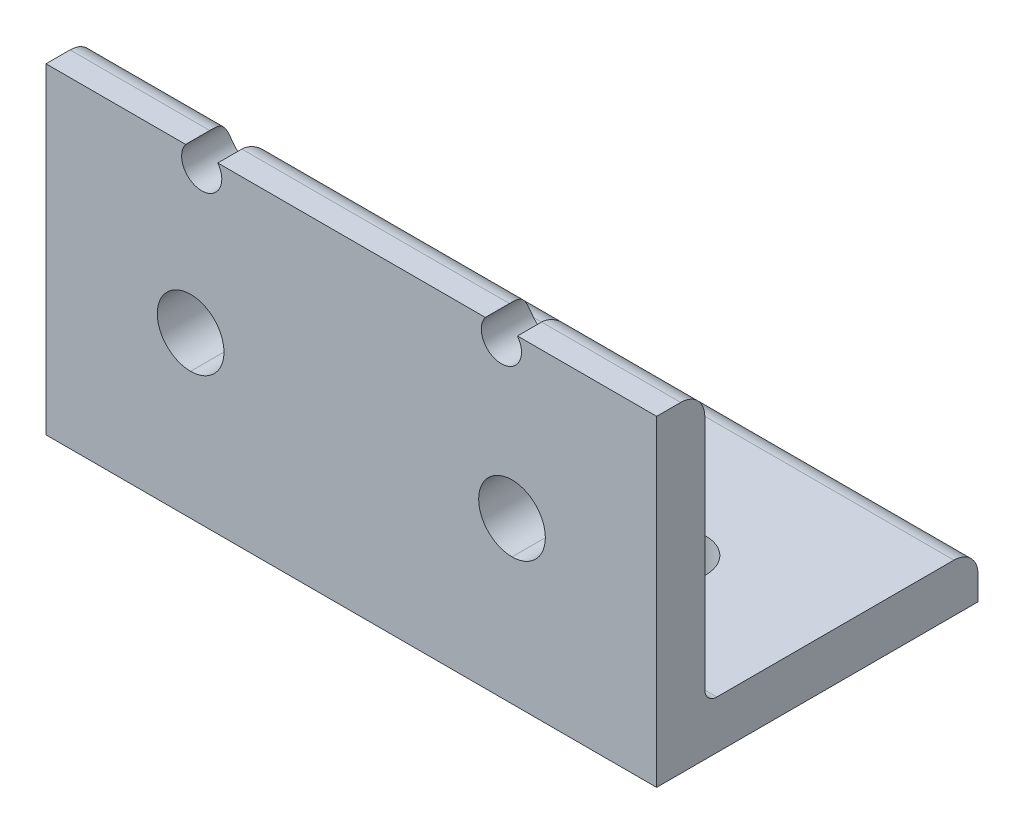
ISO-10303-21;
HEADER;
FILE_DESCRIPTION(('STEP AP214'),'2;1');
FILE_NAME('part.step','',(''),(''),'','','');
FILE_SCHEMA(('AUTOMOTIVE_DESIGN { 1 0 10303 214 1 1 1 1 }'));
ENDSEC;
DATA;
#1=APPLICATION_CONTEXT('core data for automotive mechanical design processes');
#2=APPLICATION_PROTOCOL_DEFINITION('international standard','automotive_design',2000,#1);
#3=PRODUCT_CONTEXT('',#1,'mechanical');
#4=PRODUCT('Part','Part','',(#3));
#5=PRODUCT_RELATED_PRODUCT_CATEGORY('part','',(#4));
#6=PRODUCT_DEFINITION_FORMATION('','',#4);
#7=PRODUCT_DEFINITION_CONTEXT('part definition',#1,'design');
#8=PRODUCT_DEFINITION('design','',#6,#7);
#9=PRODUCT_DEFINITION_SHAPE('','',#8);
#10=(LENGTH_UNIT() NAMED_UNIT(*) SI_UNIT(.MILLI.,.METRE.));
#11=(NAMED_UNIT(*) PLANE_ANGLE_UNIT() SI_UNIT($,.RADIAN.));
#12=(NAMED_UNIT(*) SI_UNIT($,.STERADIAN.) SOLID_ANGLE_UNIT());
#13=UNCERTAINTY_MEASURE_WITH_UNIT(LENGTH_MEASURE(1.E-05),#10,'distance_accuracy_value','');
#14=(GEOMETRIC_REPRESENTATION_CONTEXT(3) GLOBAL_UNCERTAINTY_ASSIGNED_CONTEXT((#13)) GLOBAL_UNIT_ASSIGNED_CONTEXT((#10,
#11,#12)) REPRESENTATION_CONTEXT('',''));
#15=CARTESIAN_POINT('',(0.,0.,0.));
#16=DIRECTION('',(0.,0.,1.));
#17=DIRECTION('',(1.,0.,0.));
#18=AXIS2_PLACEMENT_3D('',#15,#16,#17);
#19=CARTESIAN_POINT('',(77.5199999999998,37.0000000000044,-3.0000000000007));
#20=DIRECTION('',(-1.,0.,0.));
#21=DIRECTION('',(0.,1.,0.));
#22=AXIS2_PLACEMENT_3D('',#19,#20,#21);
#23=CYLINDRICAL_SURFACE('',#22,3.0000000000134);
#24=CARTESIAN_POINT('',(54.6795507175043,37.0000000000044,-6.0000000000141));
#25=CARTESIAN_POINT('',(54.6449193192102,37.0461604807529,-6.00000555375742));
#26=CARTESIAN_POINT('',(54.6118943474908,37.0935385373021,-5.99893451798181));
#27=CARTESIAN_POINT('',(54.5492326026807,37.1903962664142,-5.99434346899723));
#28=CARTESIAN_POINT('',(54.5195972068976,37.2398767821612,-5.99082246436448));
#29=CARTESIAN_POINT('',(54.4639462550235,37.3405174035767,-5.98104010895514));
#30=CARTESIAN_POINT('',(54.4379270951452,37.391675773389,-5.97478151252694));
#31=CARTESIAN_POINT('',(54.3896213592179,37.4952630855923,-5.95930135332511));
#32=CARTESIAN_POINT('',(54.3673341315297,37.5476918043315,-5.95008030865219));
#33=CARTESIAN_POINT('',(54.3060993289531,37.7065409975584,-5.917609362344));
#34=CARTESIAN_POINT('',(54.2728981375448,37.8143065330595,-5.88957064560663));
#35=CARTESIAN_POINT('',(54.2218359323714,38.029004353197,-5.82026341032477));
#36=CARTESIAN_POINT('',(54.2039609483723,38.1359373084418,-5.77900698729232));
#37=CARTESIAN_POINT('',(54.1823774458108,38.3428778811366,-5.68501012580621));
#38=CARTESIAN_POINT('',(54.1783328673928,38.4429909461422,-5.63257551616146));
#39=CARTESIAN_POINT('',(54.1814013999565,38.6365539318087,-5.51683254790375));
#40=CARTESIAN_POINT('',(54.1885256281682,38.7299971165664,-5.4535134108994));
#41=CARTESIAN_POINT('',(54.2158865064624,38.9424771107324,-5.29145707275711));
#42=CARTESIAN_POINT('',(54.2400813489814,39.0577214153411,-5.18841126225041));
#43=CARTESIAN_POINT('',(54.298535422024,39.2700312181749,-4.96737477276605));
#44=CARTESIAN_POINT('',(54.3328167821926,39.3670559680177,-4.8493515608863));
#45=CARTESIAN_POINT('',(54.4056155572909,39.543289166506,-4.59862153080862));
#46=CARTESIAN_POINT('',(54.4441972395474,39.6221516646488,-4.46569168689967));
#47=CARTESIAN_POINT('',(54.5181327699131,39.7586885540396,-4.18884386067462));
#48=CARTESIAN_POINT('',(54.5534952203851,39.8164207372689,-4.04495716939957));
#49=CARTESIAN_POINT('',(54.5982350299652,39.8852193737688,-3.82528617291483));
#50=CARTESIAN_POINT('',(54.6115697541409,39.9049500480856,-3.75294170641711));
#51=CARTESIAN_POINT('',(54.6351282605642,39.9390150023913,-3.60649659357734));
#52=CARTESIAN_POINT('',(54.6453530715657,39.9533510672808,-3.53239653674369));
#53=CARTESIAN_POINT('',(54.6620950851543,39.9765132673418,-3.38232155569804));
#54=CARTESIAN_POINT('',(54.668582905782,39.9852957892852,-3.30633654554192));
#55=CARTESIAN_POINT('',(54.6773397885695,39.9970515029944,-3.15357753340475));
#56=CARTESIAN_POINT('',(54.6796031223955,40.0000168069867,-3.07680260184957));
#57=CARTESIAN_POINT('',(54.6795507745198,40.0000000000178,-3.00000000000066));
#58=B_SPLINE_CURVE_WITH_KNOTS('',3,(#24,#25,#26,#27,#28,#29,#30,#31,#32,#33,#34,#35,#36,#37,#38,
#39,#40,#41,#42,#43,#44,#45,#46,#47,#48,#49,#50,#51,#52,#53,#54,#55,#56,#57),.UNSPECIFIED.,.F.,
.F.,(4,2,2,2,2,2,2,2,2,2,2,2,2,2,2,2,4),(0.,0.173090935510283,0.346251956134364,
0.519239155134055,0.692196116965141,1.0388479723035,1.38518350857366,1.72304135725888,
2.06123571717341,2.52812901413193,2.9960544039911,3.47226658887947,3.94716641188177,
4.17543250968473,4.40362301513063,4.6335839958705,4.86385657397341),.UNSPECIFIED.);
#59=CARTESIAN_POINT('',(54.6795507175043,37.0000000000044,-5.99999999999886));
#60=VERTEX_POINT('',#59);
#61=CARTESIAN_POINT('',(54.67955077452,40.0000000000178,-3.0000000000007));
#62=VERTEX_POINT('',#61);
#63=EDGE_CURVE('E523',#60,#62,#58,.T.);
#64=ORIENTED_EDGE('',*,*,#63,.F.);
#65=DIRECTION('',(1.,0.,0.));
#66=VECTOR('',#65,1.);
#67=CARTESIAN_POINT('',(0.,37.0000000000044,-6.0000000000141));
#68=LINE('',#67,#66);
#69=CARTESIAN_POINT('',(21.3795506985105,37.0000000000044,-6.0000000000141));
#70=VERTEX_POINT('',#69);
#71=EDGE_CURVE('E519',#70,#60,#68,.T.);
#72=ORIENTED_EDGE('',*,*,#71,.F.);
#73=CARTESIAN_POINT('',(21.3795506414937,40.0000000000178,-3.0000000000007));
#74=CARTESIAN_POINT('',(21.3795004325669,40.0000160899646,-3.0759560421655));
#75=CARTESIAN_POINT('',(21.3817131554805,39.9971160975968,-3.15188584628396));
#76=CARTESIAN_POINT('',(21.3902803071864,39.9856169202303,-3.30298305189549));
#77=CARTESIAN_POINT('',(21.3966294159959,39.977025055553,-3.37815130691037));
#78=CARTESIAN_POINT('',(21.4130169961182,39.9543712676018,-3.52657955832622));
#79=CARTESIAN_POINT('',(21.4230236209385,39.9403565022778,-3.59985034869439));
#80=CARTESIAN_POINT('',(21.4460961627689,39.9070542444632,-3.74468955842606));
#81=CARTESIAN_POINT('',(21.4591629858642,39.8877651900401,-3.81625746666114));
#82=CARTESIAN_POINT('',(21.5017419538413,39.822495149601,-4.02717638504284));
#83=CARTESIAN_POINT('',(21.5347376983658,39.7689827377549,-4.16356367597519));
#84=CARTESIAN_POINT('',(21.6041003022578,39.6430509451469,-4.42678227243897));
#85=CARTESIAN_POINT('',(21.6404785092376,39.5705663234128,-4.55357861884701));
#86=CARTESIAN_POINT('',(21.71650958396,39.3940312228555,-4.81589056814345));
#87=CARTESIAN_POINT('',(21.7557191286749,39.2867517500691,-4.94941845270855));
#88=CARTESIAN_POINT('',(21.8050737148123,39.1087929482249,-5.13549943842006));
#89=CARTESIAN_POINT('',(21.8199430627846,39.0466720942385,-5.19512918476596));
#90=CARTESIAN_POINT('',(21.8454043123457,38.9170445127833,-5.30919658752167));
#91=CARTESIAN_POINT('',(21.8559983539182,38.8495405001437,-5.3636368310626));
#92=CARTESIAN_POINT('',(21.8748869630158,38.6816326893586,-5.48734265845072));
#93=CARTESIAN_POINT('',(21.8805765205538,38.5788504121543,-5.55385411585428));
#94=CARTESIAN_POINT('',(21.8782217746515,38.3661002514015,-5.67369460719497));
#95=CARTESIAN_POINT('',(21.8701956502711,38.2561420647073,-5.72704098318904));
#96=CARTESIAN_POINT('',(21.8379614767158,38.0319259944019,-5.81955660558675));
#97=CARTESIAN_POINT('',(21.8136696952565,37.9176487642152,-5.85865086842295));
#98=CARTESIAN_POINT('',(21.7476243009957,37.6898908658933,-5.92199064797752));
#99=CARTESIAN_POINT('',(21.7058574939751,37.5764108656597,-5.94622491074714));
#100=CARTESIAN_POINT('',(21.6184173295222,37.3839401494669,-5.97648973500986));
#101=CARTESIAN_POINT('',(21.576582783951,37.3036531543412,-5.98561495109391));
#102=CARTESIAN_POINT('',(21.507376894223,37.1868347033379,-5.99443093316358));
#103=CARTESIAN_POINT('',(21.4832517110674,37.1485227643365,-5.99655783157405));
#104=CARTESIAN_POINT('',(21.4329319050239,37.0732282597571,-5.99934297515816));
#105=CARTESIAN_POINT('',(21.4067373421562,37.0362456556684,-6.00000126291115));
#106=CARTESIAN_POINT('',(21.3795506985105,37.0000000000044,-6.0000000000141));
#107=B_SPLINE_CURVE_WITH_KNOTS('',3,(#73,#74,#75,#76,#77,#78,#79,#80,#81,#82,#83,#84,#85,#86,
#87,#88,#89,#90,#91,#92,#93,#94,#95,#96,#97,#98,#99,#100,#101,#102,#103,#104,#105,#106),
.UNSPECIFIED.,.F.,.F.,(4,2,2,2,2,2,2,2,2,2,2,2,2,2,2,2,4),(0.,0.227738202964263,
0.455184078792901,0.68069497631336,0.9062727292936,1.3549442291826,1.80517935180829,
2.32935378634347,2.59115439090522,2.85282378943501,3.21892209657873,3.5845355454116,
3.95204571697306,4.31983387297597,4.59200180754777,4.72789580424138,4.86378586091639),.UNSPECIFIED.);
#108=CARTESIAN_POINT('',(21.3795506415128,39.9999999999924,-3.00000000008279));
#109=VERTEX_POINT('',#108);
#110=EDGE_CURVE('E552',#109,#70,#107,.T.);
#111=ORIENTED_EDGE('',*,*,#110,.F.);
#112=DIRECTION('',(-1.,0.,0.));
#113=VECTOR('',#112,1.);
#114=CARTESIAN_POINT('',(76.0000000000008,40.0000000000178,-3.0000000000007));
#115=LINE('',#114,#113);
#116=EDGE_CURVE('E228',#62,#109,#115,.T.);
#117=ORIENTED_EDGE('',*,*,#116,.F.);
#118=EDGE_LOOP('',(#64,#72,#111,#117));
#119=FACE_BOUND('',#118,.T.);
#120=ADVANCED_FACE('F50',(#119),#23,.T.);
#121=CARTESIAN_POINT('',(17.3795506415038,37.0000000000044,-6.0000000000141));
#122=CARTESIAN_POINT('',(17.3449192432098,37.0461604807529,-6.00000555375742));
#123=CARTESIAN_POINT('',(17.3118942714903,37.0935385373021,-5.99893451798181));
#124=CARTESIAN_POINT('',(17.2492325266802,37.1903962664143,-5.99434346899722));
#125=CARTESIAN_POINT('',(17.2195971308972,37.2398767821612,-5.99082246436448));
#126=CARTESIAN_POINT('',(17.1639461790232,37.3405174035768,-5.98104010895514));
#127=CARTESIAN_POINT('',(17.1379270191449,37.391675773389,-5.97478151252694));
#128=CARTESIAN_POINT('',(17.0896212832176,37.4952630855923,-5.9593013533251));
#129=CARTESIAN_POINT('',(17.0673340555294,37.5476918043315,-5.95008030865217));
#130=CARTESIAN_POINT('',(17.0060992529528,37.7065409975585,-5.91760936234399));
#131=CARTESIAN_POINT('',(16.9728980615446,37.8143065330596,-5.8895706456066));
#132=CARTESIAN_POINT('',(16.9218358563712,38.0290043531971,-5.82026341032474));
#133=CARTESIAN_POINT('',(16.9039608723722,38.1359373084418,-5.77900698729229));
#134=CARTESIAN_POINT('',(16.8823773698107,38.3428778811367,-5.68501012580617));
#135=CARTESIAN_POINT('',(16.8783327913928,38.4429909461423,-5.63257551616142));
#136=CARTESIAN_POINT('',(16.8814013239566,38.6365539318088,-5.5168325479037));
#137=CARTESIAN_POINT('',(16.8885255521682,38.7299971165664,-5.45351341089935));
#138=CARTESIAN_POINT('',(16.9158864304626,38.9424771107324,-5.29145707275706));
#139=CARTESIAN_POINT('',(16.9400812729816,39.0577214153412,-5.18841126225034));
#140=CARTESIAN_POINT('',(16.9985353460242,39.270031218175,-4.96737477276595));
#141=CARTESIAN_POINT('',(17.0328167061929,39.3670559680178,-4.84935156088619));
#142=CARTESIAN_POINT('',(17.1056154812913,39.5432891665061,-4.59862153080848));
#143=CARTESIAN_POINT('',(17.1441971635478,39.6221516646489,-4.46569168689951));
#144=CARTESIAN_POINT('',(17.2181326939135,39.7586885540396,-4.18884386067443));
#145=CARTESIAN_POINT('',(17.2534951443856,39.816420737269,-4.04495716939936));
#146=CARTESIAN_POINT('',(17.2982349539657,39.8852193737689,-3.82528617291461));
#147=CARTESIAN_POINT('',(17.3115696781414,39.9049500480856,-3.75294170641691));
#148=CARTESIAN_POINT('',(17.3351281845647,39.9390150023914,-3.60649659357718));
#149=CARTESIAN_POINT('',(17.3453529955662,39.9533510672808,-3.53239653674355));
#150=CARTESIAN_POINT('',(17.3620950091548,39.9765132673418,-3.38232155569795));
#151=CARTESIAN_POINT('',(17.3685828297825,39.9852957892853,-3.30633654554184));
#152=CARTESIAN_POINT('',(17.37733971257,39.9970515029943,-3.15357753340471));
#153=CARTESIAN_POINT('',(17.379603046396,40.0000168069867,-3.07680260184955));
#154=CARTESIAN_POINT('',(17.3795506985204,40.0000000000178,-3.00000000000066));
#155=B_SPLINE_CURVE_WITH_KNOTS('',3,(#121,#122,#123,#124,#125,#126,#127,#128,#129,#130,#131,
#132,#133,#134,#135,#136,#137,#138,#139,#140,#141,#142,#143,#144,#145,#146,#147,#148,#149,#150,
#151,#152,#153,#154),.UNSPECIFIED.,.F.,.F.,(4,2,2,2,2,2,2,2,2,2,2,2,2,2,2,2,4),(0.,
0.17309093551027,0.34625195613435,0.519239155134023,0.692196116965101,1.03884797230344,
1.38518350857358,1.7230413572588,2.06123571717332,2.52812901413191,2.99605440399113,
3.47226658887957,3.94716641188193,4.17543250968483,4.40362301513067,4.63358399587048,
4.86385657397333),.UNSPECIFIED.);
#156=CARTESIAN_POINT('',(17.3795506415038,37.0000000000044,-5.99999999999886));
#157=VERTEX_POINT('',#156);
#158=CARTESIAN_POINT('',(17.3795506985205,40.0000000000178,-3.0000000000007));
#159=VERTEX_POINT('',#158);
#160=EDGE_CURVE('E205',#157,#159,#155,.T.);
#161=ORIENTED_EDGE('',*,*,#160,.F.);
#162=CARTESIAN_POINT('',(0.,37.0000000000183,-6.00000000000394));
#163=VERTEX_POINT('',#162);
#164=EDGE_CURVE('E518',#163,#157,#68,.T.);
#165=ORIENTED_EDGE('',*,*,#164,.F.);
#166=CARTESIAN_POINT('',(0.,37.0000000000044,-3.0000000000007));
#167=DIRECTION('',(1.,0.,0.));
#168=DIRECTION('',(0.,1.38847267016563E-11,-1.));
#169=AXIS2_PLACEMENT_3D('',#166,#167,#168);
#170=CIRCLE('',#169,3.0000000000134);
#171=CARTESIAN_POINT('',(0.,40.0000000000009,-3.00000000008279));
#172=VERTEX_POINT('',#171);
#173=EDGE_CURVE('E238',#163,#172,#170,.T.);
#174=ORIENTED_EDGE('',*,*,#173,.T.);
#175=EDGE_CURVE('E230',#159,#172,#115,.T.);
#176=ORIENTED_EDGE('',*,*,#175,.F.);
#177=EDGE_LOOP('',(#161,#165,#174,#176));
#178=FACE_BOUND('',#177,.T.);
#179=ADVANCED_FACE('F421',(#178),#23,.T.);
#180=CARTESIAN_POINT('',(38.0000000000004,39.9999999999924,-1.5000000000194));
#181=DIRECTION('',(0.,1.,0.));
#182=DIRECTION('',(0.,0.,1.));
#183=AXIS2_PLACEMENT_3D('',#180,#181,#182);
#184=PLANE('',#183);
#185=DIRECTION('',(0.,0.,1.));
#186=VECTOR('',#185,1.);
#187=CARTESIAN_POINT('',(54.679550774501,39.9999999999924,-40.0000000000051));
#188=LINE('',#187,#186);
#189=CARTESIAN_POINT('',(54.679550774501,39.9999999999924,0.));
#190=VERTEX_POINT('',#189);
#191=EDGE_CURVE('E12',#62,#190,#188,.T.);
#192=ORIENTED_EDGE('',*,*,#191,.F.);
#193=ORIENTED_EDGE('',*,*,#116,.T.);
#194=DIRECTION('',(0.,0.,1.));
#195=VECTOR('',#194,1.);
#196=CARTESIAN_POINT('',(21.3795506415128,39.9999999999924,-40.0000000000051));
#197=LINE('',#196,#195);
#198=CARTESIAN_POINT('',(21.3795506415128,39.9999999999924,0.));
#199=VERTEX_POINT('',#198);
#200=EDGE_CURVE('E209',#199,#109,#197,.F.);
#201=ORIENTED_EDGE('',*,*,#200,.F.);
#202=DIRECTION('',(-1.,0.,0.));
#203=VECTOR('',#202,1.);
#204=CARTESIAN_POINT('',(76.0000000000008,39.9999999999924,0.));
#205=LINE('',#204,#203);
#206=EDGE_CURVE('E218',#190,#199,#205,.T.);
#207=ORIENTED_EDGE('',*,*,#206,.F.);
#208=EDGE_LOOP('',(#192,#193,#201,#207));
#209=FACE_BOUND('',#208,.T.);
#210=ADVANCED_FACE('F430',(#209),#184,.T.);
#211=DIRECTION('',(0.,0.,1.));
#212=VECTOR('',#211,1.);
#213=CARTESIAN_POINT('',(17.3795506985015,39.9999999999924,-40.0000000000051));
#214=LINE('',#213,#212);
#215=CARTESIAN_POINT('',(17.3795506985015,39.9999999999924,0.));
#216=VERTEX_POINT('',#215);
#217=EDGE_CURVE('E202',#159,#216,#214,.T.);
#218=ORIENTED_EDGE('',*,*,#217,.F.);
#219=ORIENTED_EDGE('',*,*,#175,.T.);
#220=DIRECTION('',(0.,0.,1.));
#221=VECTOR('',#220,1.);
#222=CARTESIAN_POINT('',(0.,39.9999999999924,-3.00000000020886));
#223=LINE('',#222,#221);
#224=CARTESIAN_POINT('',(0.,39.9999999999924,0.));
#225=VERTEX_POINT('',#224);
#226=EDGE_CURVE('E223',#172,#225,#223,.T.);
#227=ORIENTED_EDGE('',*,*,#226,.T.);
#228=EDGE_CURVE('E215',#216,#225,#205,.T.);
#229=ORIENTED_EDGE('',*,*,#228,.F.);
#230=EDGE_LOOP('',(#218,#219,#227,#229));
#231=FACE_BOUND('',#230,.T.);
#232=ADVANCED_FACE('F221',(#231),#184,.T.);
#233=CARTESIAN_POINT('',(57.9999999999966,19.9999999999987,-6.11999999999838));
#234=DIRECTION('',(0.,0.,1.));
#235=DIRECTION('',(0.,-1.,0.));
#236=AXIS2_PLACEMENT_3D('',#233,#234,#235);
#237=CYLINDRICAL_SURFACE('',#236,4.15000000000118);
#238=CARTESIAN_POINT('',(57.9999999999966,19.9999999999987,-5.99999999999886));
#239=DIRECTION('',(0.,0.,1.));
#240=DIRECTION('',(0.,-1.,0.));
#241=AXIS2_PLACEMENT_3D('',#238,#239,#240);
#242=CIRCLE('',#241,4.15000000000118);
#243=CARTESIAN_POINT('',(57.9999999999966,15.8499999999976,-5.99999999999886));
#244=VERTEX_POINT('',#243);
#245=CARTESIAN_POINT('',(57.9999999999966,24.1499999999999,-5.99999999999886));
#246=VERTEX_POINT('',#245);
#247=EDGE_CURVE('E361',#244,#246,#242,.T.);
#248=ORIENTED_EDGE('',*,*,#247,.F.);
#249=DIRECTION('',(0.,0.,1.));
#250=VECTOR('',#249,1.);
#251=CARTESIAN_POINT('',(57.9999999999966,15.8499999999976,-5.99999999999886));
#252=LINE('',#251,#250);
#253=CARTESIAN_POINT('',(57.9999999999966,15.8499999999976,0.));
#254=VERTEX_POINT('',#253);
#255=EDGE_CURVE('E385',#244,#254,#252,.T.);
#256=ORIENTED_EDGE('',*,*,#255,.T.);
#257=CARTESIAN_POINT('',(57.9999999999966,19.9999999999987,0.));
#258=DIRECTION('',(0.,0.,-1.));
#259=DIRECTION('',(0.,1.,0.));
#260=AXIS2_PLACEMENT_3D('',#257,#258,#259);
#261=CIRCLE('',#260,4.15000000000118);
#262=CARTESIAN_POINT('',(57.9999999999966,24.1499999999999,0.));
#263=VERTEX_POINT('',#262);
#264=EDGE_CURVE('E395',#263,#254,#261,.T.);
#265=ORIENTED_EDGE('',*,*,#264,.F.);
#266=DIRECTION('',(0.,0.,-1.));
#267=VECTOR('',#266,1.);
#268=CARTESIAN_POINT('',(57.9999999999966,24.1499999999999,0.));
#269=LINE('',#268,#267);
#270=EDGE_CURVE('E382',#263,#246,#269,.T.);
#271=ORIENTED_EDGE('',*,*,#270,.T.);
#272=EDGE_LOOP('',(#248,#256,#265,#271));
#273=FACE_BOUND('',#272,.T.);
#274=ADVANCED_FACE('F52',(#273),#237,.F.);
#275=CARTESIAN_POINT('',(57.9999999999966,19.9999999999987,-6.11999999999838));
#276=DIRECTION('',(0.,0.,1.));
#277=DIRECTION('',(0.,-1.,0.));
#278=AXIS2_PLACEMENT_3D('',#275,#276,#277);
#279=CYLINDRICAL_SURFACE('',#278,4.15000000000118);
#280=CARTESIAN_POINT('',(57.9999999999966,19.9999999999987,-5.99999999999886));
#281=DIRECTION('',(0.,0.,1.));
#282=DIRECTION('',(0.,1.,0.));
#283=AXIS2_PLACEMENT_3D('',#280,#281,#282);
#284=CIRCLE('',#283,4.15000000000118);
#285=EDGE_CURVE('E367',#246,#244,#284,.T.);
#286=ORIENTED_EDGE('',*,*,#285,.F.);
#287=ORIENTED_EDGE('',*,*,#270,.F.);
#288=CARTESIAN_POINT('',(57.9999999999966,19.9999999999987,0.));
#289=DIRECTION('',(0.,0.,-1.));
#290=DIRECTION('',(0.,-1.,0.));
#291=AXIS2_PLACEMENT_3D('',#288,#289,#290);
#292=CIRCLE('',#291,4.15000000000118);
#293=EDGE_CURVE('E379',#254,#263,#292,.T.);
#294=ORIENTED_EDGE('',*,*,#293,.F.);
#295=ORIENTED_EDGE('',*,*,#255,.F.);
#296=EDGE_LOOP('',(#286,#287,#294,#295));
#297=FACE_BOUND('',#296,.T.);
#298=ADVANCED_FACE('F409',(#297),#279,.F.);
#299=CARTESIAN_POINT('',(38.0000000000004,19.9999999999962,0.));
#300=DIRECTION('',(0.,0.,1.));
#301=DIRECTION('',(0.,-1.,0.));
#302=AXIS2_PLACEMENT_3D('',#299,#300,#301);
#303=PLANE('',#302);
#304=CARTESIAN_POINT('',(56.6795507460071,38.4999999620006,0.));
#305=DIRECTION('',(0.,0.,1.));
#306=DIRECTION('',(1.,0.,0.));
#307=AXIS2_PLACEMENT_3D('',#304,#305,#306);
#308=CIRCLE('',#307,2.5);
#309=CARTESIAN_POINT('',(58.6795507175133,39.9999999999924,0.));
#310=VERTEX_POINT('',#309);
#311=EDGE_CURVE('E72',#190,#310,#308,.T.);
#312=ORIENTED_EDGE('',*,*,#311,.F.);
#313=ORIENTED_EDGE('',*,*,#206,.T.);
#314=CARTESIAN_POINT('',(19.3795506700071,38.4999999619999,0.));
#315=DIRECTION('',(0.,0.,1.));
#316=DIRECTION('',(1.,0.,0.));
#317=AXIS2_PLACEMENT_3D('',#314,#315,#316);
#318=CIRCLE('',#317,2.5);
#319=EDGE_CURVE('E65',#216,#199,#318,.T.);
#320=ORIENTED_EDGE('',*,*,#319,.F.);
#321=ORIENTED_EDGE('',*,*,#228,.T.);
#322=DIRECTION('',(0.,-1.,0.));
#323=VECTOR('',#322,1.);
#324=CARTESIAN_POINT('',(0.,39.9999999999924,0.));
#325=LINE('',#324,#323);
#326=CARTESIAN_POINT('',(0.,0.,0.));
#327=VERTEX_POINT('',#326);
#328=EDGE_CURVE('E246',#225,#327,#325,.T.);
#329=ORIENTED_EDGE('',*,*,#328,.T.);
#330=DIRECTION('',(1.,0.,0.));
#331=VECTOR('',#330,1.);
#332=CARTESIAN_POINT('',(0.,0.,0.));
#333=LINE('',#332,#331);
#334=CARTESIAN_POINT('',(76.0000000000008,0.,0.));
#335=VERTEX_POINT('',#334);
#336=EDGE_CURVE('E282',#327,#335,#333,.T.);
#337=ORIENTED_EDGE('',*,*,#336,.T.);
#338=DIRECTION('',(0.,1.,0.));
#339=VECTOR('',#338,1.);
#340=CARTESIAN_POINT('',(76.0000000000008,0.,0.));
#341=LINE('',#340,#339);
#342=CARTESIAN_POINT('',(76.0000000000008,39.9999999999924,0.));
#343=VERTEX_POINT('',#342);
#344=EDGE_CURVE('E396',#335,#343,#341,.T.);
#345=ORIENTED_EDGE('',*,*,#344,.T.);
#346=EDGE_CURVE('E226',#343,#310,#205,.T.);
#347=ORIENTED_EDGE('',*,*,#346,.T.);
#348=EDGE_LOOP('',(#312,#313,#320,#321,#329,#337,#345,#347));
#349=FACE_BOUND('',#348,.T.);
#350=CARTESIAN_POINT('',(17.9999999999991,19.9999999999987,0.));
#351=DIRECTION('',(0.,0.,-1.));
#352=DIRECTION('',(0.,1.,0.));
#353=AXIS2_PLACEMENT_3D('',#350,#351,#352);
#354=CIRCLE('',#353,4.15000000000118);
#355=CARTESIAN_POINT('',(17.9999999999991,24.1499999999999,0.));
#356=VERTEX_POINT('',#355);
#357=CARTESIAN_POINT('',(17.9999999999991,15.8499999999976,0.));
#358=VERTEX_POINT('',#357);
#359=EDGE_CURVE('E272',#356,#358,#354,.T.);
#360=ORIENTED_EDGE('',*,*,#359,.T.);
#361=CARTESIAN_POINT('',(17.9999999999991,19.9999999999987,0.));
#362=DIRECTION('',(0.,0.,-1.));
#363=DIRECTION('',(0.,-1.,0.));
#364=AXIS2_PLACEMENT_3D('',#361,#362,#363);
#365=CIRCLE('',#364,4.15000000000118);
#366=EDGE_CURVE('E273',#358,#356,#365,.T.);
#367=ORIENTED_EDGE('',*,*,#366,.T.);
#368=EDGE_LOOP('',(#360,#367));
#369=FACE_BOUND('',#368,.T.);
#370=ORIENTED_EDGE('',*,*,#264,.T.);
#371=ORIENTED_EDGE('',*,*,#293,.T.);
#372=EDGE_LOOP('',(#370,#371));
#373=FACE_BOUND('',#372,.T.);
#374=ADVANCED_FACE('F213',(#349,#369,#373),#303,.T.);
#375=CARTESIAN_POINT('',(17.9999999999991,19.9999999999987,-6.11999999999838));
#376=DIRECTION('',(0.,0.,1.));
#377=DIRECTION('',(0.,-1.,0.));
#378=AXIS2_PLACEMENT_3D('',#375,#376,#377);
#379=CYLINDRICAL_SURFACE('',#378,4.15000000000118);
#380=CARTESIAN_POINT('',(17.9999999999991,19.9999999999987,-5.99999999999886));
#381=DIRECTION('',(0.,0.,1.));
#382=DIRECTION('',(0.,-1.,0.));
#383=AXIS2_PLACEMENT_3D('',#380,#381,#382);
#384=CIRCLE('',#383,4.15000000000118);
#385=CARTESIAN_POINT('',(17.9999999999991,15.8499999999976,-5.99999999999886));
#386=VERTEX_POINT('',#385);
#387=CARTESIAN_POINT('',(17.9999999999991,24.1499999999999,-5.99999999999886));
#388=VERTEX_POINT('',#387);
#389=EDGE_CURVE('E256',#386,#388,#384,.T.);
#390=ORIENTED_EDGE('',*,*,#389,.F.);
#391=DIRECTION('',(0.,0.,1.));
#392=VECTOR('',#391,1.);
#393=CARTESIAN_POINT('',(17.9999999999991,15.8499999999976,-5.99999999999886));
#394=LINE('',#393,#392);
#395=EDGE_CURVE('E277',#386,#358,#394,.T.);
#396=ORIENTED_EDGE('',*,*,#395,.T.);
#397=ORIENTED_EDGE('',*,*,#359,.F.);
#398=DIRECTION('',(0.,0.,-1.));
#399=VECTOR('',#398,1.);
#400=CARTESIAN_POINT('',(17.9999999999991,24.1499999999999,0.));
#401=LINE('',#400,#399);
#402=EDGE_CURVE('E269',#356,#388,#401,.T.);
#403=ORIENTED_EDGE('',*,*,#402,.T.);
#404=EDGE_LOOP('',(#390,#396,#397,#403));
#405=FACE_BOUND('',#404,.T.);
#406=ADVANCED_FACE('F411',(#405),#379,.F.);
#407=CARTESIAN_POINT('',(17.9999999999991,19.9999999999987,-6.11999999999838));
#408=DIRECTION('',(0.,0.,1.));
#409=DIRECTION('',(0.,-1.,0.));
#410=AXIS2_PLACEMENT_3D('',#407,#408,#409);
#411=CYLINDRICAL_SURFACE('',#410,4.15000000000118);
#412=CARTESIAN_POINT('',(17.9999999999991,19.9999999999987,-5.99999999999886));
#413=DIRECTION('',(0.,0.,1.));
#414=DIRECTION('',(0.,1.,0.));
#415=AXIS2_PLACEMENT_3D('',#412,#413,#414);
#416=CIRCLE('',#415,4.15000000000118);
#417=EDGE_CURVE('E252',#388,#386,#416,.T.);
#418=ORIENTED_EDGE('',*,*,#417,.F.);
#419=ORIENTED_EDGE('',*,*,#402,.F.);
#420=ORIENTED_EDGE('',*,*,#366,.F.);
#421=ORIENTED_EDGE('',*,*,#395,.F.);
#422=EDGE_LOOP('',(#418,#419,#420,#421));
#423=FACE_BOUND('',#422,.T.);
#424=ADVANCED_FACE('F417',(#423),#411,.F.);
#425=CARTESIAN_POINT('',(17.9999999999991,-0.119999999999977,-19.9999999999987));
#426=DIRECTION('',(0.,1.,0.));
#427=DIRECTION('',(1.,0.,0.));
#428=AXIS2_PLACEMENT_3D('',#425,#426,#427);
#429=CYLINDRICAL_SURFACE('',#428,4.15000000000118);
#430=CARTESIAN_POINT('',(17.9999999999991,5.99999999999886,-19.9999999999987));
#431=DIRECTION('',(0.,-1.,0.));
#432=DIRECTION('',(-1.,0.,0.));
#433=AXIS2_PLACEMENT_3D('',#430,#431,#432);
#434=CIRCLE('',#433,4.15000000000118);
#435=CARTESIAN_POINT('',(13.8499999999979,5.99999999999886,-19.9999999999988));
#436=VERTEX_POINT('',#435);
#437=CARTESIAN_POINT('',(22.1500000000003,5.99999999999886,-19.9999999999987));
#438=VERTEX_POINT('',#437);
#439=EDGE_CURVE('E342',#436,#438,#434,.T.);
#440=ORIENTED_EDGE('',*,*,#439,.F.);
#441=DIRECTION('',(0.,-1.,0.));
#442=VECTOR('',#441,1.);
#443=CARTESIAN_POINT('',(13.8499999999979,5.99999999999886,-19.9999999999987));
#444=LINE('',#443,#442);
#445=CARTESIAN_POINT('',(13.8499999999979,0.,-19.9999999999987));
#446=VERTEX_POINT('',#445);
#447=EDGE_CURVE('E274',#436,#446,#444,.T.);
#448=ORIENTED_EDGE('',*,*,#447,.T.);
#449=CARTESIAN_POINT('',(17.9999999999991,0.,-19.9999999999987));
#450=DIRECTION('',(0.,1.,0.));
#451=DIRECTION('',(1.,0.,0.));
#452=AXIS2_PLACEMENT_3D('',#449,#450,#451);
#453=CIRCLE('',#452,4.15000000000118);
#454=CARTESIAN_POINT('',(22.1500000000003,0.,-19.9999999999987));
#455=VERTEX_POINT('',#454);
#456=EDGE_CURVE('E474',#455,#446,#453,.T.);
#457=ORIENTED_EDGE('',*,*,#456,.F.);
#458=DIRECTION('',(0.,1.,0.));
#459=VECTOR('',#458,1.);
#460=CARTESIAN_POINT('',(22.1500000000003,0.,-19.9999999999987));
#461=LINE('',#460,#459);
#462=EDGE_CURVE('E281',#455,#438,#461,.T.);
#463=ORIENTED_EDGE('',*,*,#462,.T.);
#464=EDGE_LOOP('',(#440,#448,#457,#463));
#465=FACE_BOUND('',#464,.T.);
#466=ADVANCED_FACE('F499',(#465),#429,.F.);
#467=CARTESIAN_POINT('',(17.9999999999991,-0.119999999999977,-19.9999999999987));
#468=DIRECTION('',(0.,1.,0.));
#469=DIRECTION('',(1.,0.,0.));
#470=AXIS2_PLACEMENT_3D('',#467,#468,#469);
#471=CYLINDRICAL_SURFACE('',#470,4.15000000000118);
#472=CARTESIAN_POINT('',(17.9999999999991,5.99999999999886,-19.9999999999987));
#473=DIRECTION('',(0.,-1.,0.));
#474=DIRECTION('',(1.,0.,0.));
#475=AXIS2_PLACEMENT_3D('',#472,#473,#474);
#476=CIRCLE('',#475,4.15000000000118);
#477=EDGE_CURVE('E338',#438,#436,#476,.T.);
#478=ORIENTED_EDGE('',*,*,#477,.F.);
#479=ORIENTED_EDGE('',*,*,#462,.F.);
#480=CARTESIAN_POINT('',(17.9999999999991,0.,-19.9999999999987));
#481=DIRECTION('',(0.,1.,0.));
#482=DIRECTION('',(-1.,0.,0.));
#483=AXIS2_PLACEMENT_3D('',#480,#481,#482);
#484=CIRCLE('',#483,4.15000000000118);
#485=EDGE_CURVE('E476',#446,#455,#484,.T.);
#486=ORIENTED_EDGE('',*,*,#485,.F.);
#487=ORIENTED_EDGE('',*,*,#447,.F.);
#488=EDGE_LOOP('',(#478,#479,#486,#487));
#489=FACE_BOUND('',#488,.T.);
#490=ADVANCED_FACE('F491',(#489),#471,.F.);
#491=CARTESIAN_POINT('',(77.5199999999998,3.0000000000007,-37.0000000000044));
#492=DIRECTION('',(-1.,0.,0.));
#493=DIRECTION('',(0.,1.,0.));
#494=AXIS2_PLACEMENT_3D('',#491,#492,#493);
#495=CYLINDRICAL_SURFACE('',#494,3.0000000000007);
#496=CARTESIAN_POINT('',(76.0000000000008,3.0000000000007,-37.0000000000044));
#497=DIRECTION('',(1.,0.,0.));
#498=DIRECTION('',(0.,6.94097557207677E-11,-1.));
#499=AXIS2_PLACEMENT_3D('',#496,#497,#498);
#500=CIRCLE('',#499,3.0000000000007);
#501=CARTESIAN_POINT('',(76.0000000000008,3.00000000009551,-39.9999999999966));
#502=VERTEX_POINT('',#501);
#503=CARTESIAN_POINT('',(76.0000000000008,5.99999999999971,-37.0000000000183));
#504=VERTEX_POINT('',#503);
#505=EDGE_CURVE('E469',#502,#504,#500,.T.);
#506=ORIENTED_EDGE('',*,*,#505,.F.);
#507=DIRECTION('',(1.,0.,0.));
#508=VECTOR('',#507,1.);
#509=CARTESIAN_POINT('',(0.,3.0000000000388,-40.0000000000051));
#510=LINE('',#509,#508);
#511=CARTESIAN_POINT('',(0.,3.00000000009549,-39.9999999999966));
#512=VERTEX_POINT('',#511);
#513=EDGE_CURVE('E353',#512,#502,#510,.T.);
#514=ORIENTED_EDGE('',*,*,#513,.F.);
#515=CARTESIAN_POINT('',(0.,3.0000000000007,-37.0000000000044));
#516=DIRECTION('',(1.,0.,0.));
#517=DIRECTION('',(0.,6.93947214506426E-11,-1.));
#518=AXIS2_PLACEMENT_3D('',#515,#516,#517);
#519=CIRCLE('',#518,3.0000000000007);
#520=CARTESIAN_POINT('',(0.,5.9999999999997,-37.0000000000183));
#521=VERTEX_POINT('',#520);
#522=EDGE_CURVE('E285',#512,#521,#519,.T.);
#523=ORIENTED_EDGE('',*,*,#522,.T.);
#524=DIRECTION('',(-1.,0.,0.));
#525=VECTOR('',#524,1.);
#526=CARTESIAN_POINT('',(76.0000000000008,6.0000000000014,-37.0000000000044));
#527=LINE('',#526,#525);
#528=EDGE_CURVE('E343',#504,#521,#527,.T.);
#529=ORIENTED_EDGE('',*,*,#528,.F.);
#530=EDGE_LOOP('',(#506,#514,#523,#529));
#531=FACE_BOUND('',#530,.T.);
#532=ADVANCED_FACE('F489',(#531),#495,.T.);
#533=CARTESIAN_POINT('',(38.0000000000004,5.99999999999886,-22.250000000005));
#534=DIRECTION('',(0.,1.,0.));
#535=DIRECTION('',(0.,0.,1.));
#536=AXIS2_PLACEMENT_3D('',#533,#534,#535);
#537=PLANE('',#536);
#538=ORIENTED_EDGE('',*,*,#439,.T.);
#539=ORIENTED_EDGE('',*,*,#477,.T.);
#540=EDGE_LOOP('',(#538,#539));
#541=FACE_BOUND('',#540,.T.);
#542=CARTESIAN_POINT('',(57.9999999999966,5.99999999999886,-19.9999999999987));
#543=DIRECTION('',(0.,-1.,0.));
#544=DIRECTION('',(-1.,0.,0.));
#545=AXIS2_PLACEMENT_3D('',#542,#543,#544);
#546=CIRCLE('',#545,4.1500000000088);
#547=CARTESIAN_POINT('',(53.8499999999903,5.99999999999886,-19.9999999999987));
#548=VERTEX_POINT('',#547);
#549=CARTESIAN_POINT('',(62.1500000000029,5.99999999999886,-19.9999999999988));
#550=VERTEX_POINT('',#549);
#551=EDGE_CURVE('E314',#548,#550,#546,.T.);
#552=ORIENTED_EDGE('',*,*,#551,.T.);
#553=CARTESIAN_POINT('',(57.9999999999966,5.99999999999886,-19.9999999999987));
#554=DIRECTION('',(0.,-1.,0.));
#555=DIRECTION('',(1.,0.,0.));
#556=AXIS2_PLACEMENT_3D('',#553,#554,#555);
#557=CIRCLE('',#556,4.1500000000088);
#558=EDGE_CURVE('E335',#550,#548,#557,.T.);
#559=ORIENTED_EDGE('',*,*,#558,.T.);
#560=EDGE_LOOP('',(#552,#559));
#561=FACE_BOUND('',#560,.T.);
#562=DIRECTION('',(-1.,0.,0.));
#563=VECTOR('',#562,1.);
#564=CARTESIAN_POINT('',(76.0000000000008,6.0000000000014,-7.50000000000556));
#565=LINE('',#564,#563);
#566=CARTESIAN_POINT('',(76.0000000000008,5.99999999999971,-7.50000000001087));
#567=VERTEX_POINT('',#566);
#568=CARTESIAN_POINT('',(0.,5.9999999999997,-7.5000000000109));
#569=VERTEX_POINT('',#568);
#570=EDGE_CURVE('E356',#567,#569,#565,.T.);
#571=ORIENTED_EDGE('',*,*,#570,.F.);
#572=DIRECTION('',(0.,0.,-1.));
#573=VECTOR('',#572,1.);
#574=CARTESIAN_POINT('',(76.0000000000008,5.99999999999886,-7.50000000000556));
#575=LINE('',#574,#573);
#576=EDGE_CURVE('E468',#567,#504,#575,.T.);
#577=ORIENTED_EDGE('',*,*,#576,.T.);
#578=ORIENTED_EDGE('',*,*,#528,.T.);
#579=DIRECTION('',(0.,0.,1.));
#580=VECTOR('',#579,1.);
#581=CARTESIAN_POINT('',(0.,5.99999999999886,-37.0000000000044));
#582=LINE('',#581,#580);
#583=EDGE_CURVE('E287',#521,#569,#582,.T.);
#584=ORIENTED_EDGE('',*,*,#583,.T.);
#585=EDGE_LOOP('',(#571,#577,#578,#584));
#586=FACE_BOUND('',#585,.T.);
#587=ADVANCED_FACE('F448',(#541,#561,#586),#537,.T.);
#588=CARTESIAN_POINT('',(-1.52000000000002,7.50000000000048,-7.50000000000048));
#589=DIRECTION('',(1.,0.,0.));
#590=DIRECTION('',(0.,0.,1.));
#591=AXIS2_PLACEMENT_3D('',#588,#589,#590);
#592=CYLINDRICAL_SURFACE('',#591,1.49999999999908);
#593=ORIENTED_EDGE('',*,*,#570,.T.);
#594=CARTESIAN_POINT('',(0.,7.50000000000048,-7.50000000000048));
#595=DIRECTION('',(-1.,0.,0.));
#596=DIRECTION('',(0.,-1.,-1.40732333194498E-11));
#597=AXIS2_PLACEMENT_3D('',#594,#595,#596);
#598=CIRCLE('',#597,1.49999999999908);
#599=CARTESIAN_POINT('',(0.,7.5000000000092,-5.99999999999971));
#600=VERTEX_POINT('',#599);
#601=EDGE_CURVE('E292',#569,#600,#598,.T.);
#602=ORIENTED_EDGE('',*,*,#601,.T.);
#603=DIRECTION('',(1.,0.,0.));
#604=VECTOR('',#603,1.);
#605=CARTESIAN_POINT('',(0.,7.50000000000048,-6.0000000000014));
#606=LINE('',#605,#604);
#607=CARTESIAN_POINT('',(76.0000000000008,7.50000000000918,-5.99999999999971));
#608=VERTEX_POINT('',#607);
#609=EDGE_CURVE('E257',#600,#608,#606,.T.);
#610=ORIENTED_EDGE('',*,*,#609,.T.);
#611=CARTESIAN_POINT('',(76.0000000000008,7.50000000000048,-7.50000000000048));
#612=DIRECTION('',(-1.,0.,0.));
#613=DIRECTION('',(0.,-1.,-1.40107832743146E-11));
#614=AXIS2_PLACEMENT_3D('',#611,#612,#613);
#615=CIRCLE('',#614,1.49999999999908);
#616=EDGE_CURVE('E322',#567,#608,#615,.T.);
#617=ORIENTED_EDGE('',*,*,#616,.F.);
#618=EDGE_LOOP('',(#593,#602,#610,#617));
#619=FACE_BOUND('',#618,.T.);
#620=ADVANCED_FACE('F438',(#619),#592,.F.);
#621=CARTESIAN_POINT('',(58.6795507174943,40.0000000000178,-3.0000000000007));
#622=CARTESIAN_POINT('',(58.6795005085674,40.0000160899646,-3.07595604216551));
#623=CARTESIAN_POINT('',(58.6817132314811,39.9971160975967,-3.15188584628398));
#624=CARTESIAN_POINT('',(58.6902803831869,39.9856169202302,-3.30298305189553));
#625=CARTESIAN_POINT('',(58.6966294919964,39.977025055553,-3.37815130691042));
#626=CARTESIAN_POINT('',(58.7130170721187,39.9543712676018,-3.52657955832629));
#627=CARTESIAN_POINT('',(58.7230236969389,39.9403565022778,-3.59985034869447));
#628=CARTESIAN_POINT('',(58.7460962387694,39.9070542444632,-3.74468955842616));
#629=CARTESIAN_POINT('',(58.7591630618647,39.88776519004,-3.81625746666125));
#630=CARTESIAN_POINT('',(58.8017420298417,39.8224951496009,-4.02717638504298));
#631=CARTESIAN_POINT('',(58.8347377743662,39.7689827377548,-4.16356367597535));
#632=CARTESIAN_POINT('',(58.9041003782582,39.6430509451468,-4.42678227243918));
#633=CARTESIAN_POINT('',(58.940478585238,39.5705663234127,-4.55357861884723));
#634=CARTESIAN_POINT('',(59.0165096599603,39.3940312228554,-4.81589056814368));
#635=CARTESIAN_POINT('',(59.0557192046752,39.2867517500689,-4.94941845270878));
#636=CARTESIAN_POINT('',(59.1050737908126,39.1087929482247,-5.13549943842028));
#637=CARTESIAN_POINT('',(59.1199431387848,39.0466720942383,-5.19512918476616));
#638=CARTESIAN_POINT('',(59.1454043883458,38.9170445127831,-5.30919658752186));
#639=CARTESIAN_POINT('',(59.1559984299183,38.8495405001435,-5.36363683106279));
#640=CARTESIAN_POINT('',(59.1748870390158,38.6816326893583,-5.48734265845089));
#641=CARTESIAN_POINT('',(59.1805765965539,38.578850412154,-5.55385411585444));
#642=CARTESIAN_POINT('',(59.1782218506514,38.3661002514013,-5.6736946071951));
#643=CARTESIAN_POINT('',(59.170195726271,38.2561420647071,-5.72704098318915));
#644=CARTESIAN_POINT('',(59.1379615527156,38.0319259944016,-5.81955660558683));
#645=CARTESIAN_POINT('',(59.1136697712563,37.917648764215,-5.85865086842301));
#646=CARTESIAN_POINT('',(59.0476243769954,37.6898908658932,-5.92199064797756));
#647=CARTESIAN_POINT('',(59.0058575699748,37.5764108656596,-5.94622491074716));
#648=CARTESIAN_POINT('',(58.9184174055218,37.3839401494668,-5.97648973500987));
#649=CARTESIAN_POINT('',(58.8765828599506,37.3036531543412,-5.98561495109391));
#650=CARTESIAN_POINT('',(58.8073769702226,37.1868347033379,-5.99443093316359));
#651=CARTESIAN_POINT('',(58.7832517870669,37.1485227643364,-5.99655783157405));
#652=CARTESIAN_POINT('',(58.7329319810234,37.0732282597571,-5.99934297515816));
#653=CARTESIAN_POINT('',(58.7067374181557,37.0362456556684,-6.00000126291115));
#654=CARTESIAN_POINT('',(58.67955077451,37.0000000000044,-6.0000000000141));
#655=B_SPLINE_CURVE_WITH_KNOTS('',3,(#621,#622,#623,#624,#625,#626,#627,#628,#629,#630,#631,
#632,#633,#634,#635,#636,#637,#638,#639,#640,#641,#642,#643,#644,#645,#646,#647,#648,#649,#650,
#651,#652,#653,#654),.UNSPECIFIED.,.F.,.F.,(4,2,2,2,2,2,2,2,2,2,2,2,2,2,2,2,4),(0.,
0.227738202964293,0.455184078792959,0.68069497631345,0.906272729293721,1.35494422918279,
1.80517935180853,2.32935378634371,2.59115439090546,2.85282378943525,3.21892209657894,
3.58453554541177,3.95204571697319,4.31983387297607,4.59200180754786,4.72789580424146,
4.86378586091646),.UNSPECIFIED.);
#656=CARTESIAN_POINT('',(58.6795507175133,39.9999999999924,-3.00000000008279));
#657=VERTEX_POINT('',#656);
#658=CARTESIAN_POINT('',(58.67955077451,37.0000000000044,-6.0000000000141));
#659=VERTEX_POINT('',#658);
#660=EDGE_CURVE('E451',#657,#659,#655,.T.);
#661=ORIENTED_EDGE('',*,*,#660,.F.);
#662=CARTESIAN_POINT('',(76.0000000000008,40.0000000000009,-3.00000000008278));
#663=VERTEX_POINT('',#662);
#664=EDGE_CURVE('E224',#663,#657,#115,.T.);
#665=ORIENTED_EDGE('',*,*,#664,.F.);
#666=CARTESIAN_POINT('',(76.0000000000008,37.0000000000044,-3.0000000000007));
#667=DIRECTION('',(1.,0.,0.));
#668=DIRECTION('',(0.,1.38824137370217E-11,-1.));
#669=AXIS2_PLACEMENT_3D('',#666,#667,#668);
#670=CIRCLE('',#669,3.0000000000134);
#671=CARTESIAN_POINT('',(76.0000000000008,37.0000000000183,-6.00000000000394));
#672=VERTEX_POINT('',#671);
#673=EDGE_CURVE('E317',#672,#663,#670,.T.);
#674=ORIENTED_EDGE('',*,*,#673,.F.);
#675=EDGE_CURVE('E298',#659,#672,#68,.T.);
#676=ORIENTED_EDGE('',*,*,#675,.F.);
#677=EDGE_LOOP('',(#661,#665,#674,#676));
#678=FACE_BOUND('',#677,.T.);
#679=ADVANCED_FACE('F424',(#678),#23,.T.);
#680=CARTESIAN_POINT('',(38.0000000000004,22.250000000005,-5.99999999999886));
#681=DIRECTION('',(0.,0.,1.));
#682=DIRECTION('',(0.,1.,0.));
#683=AXIS2_PLACEMENT_3D('',#680,#681,#682);
#684=PLANE('',#683);
#685=ORIENTED_EDGE('',*,*,#247,.T.);
#686=ORIENTED_EDGE('',*,*,#285,.T.);
#687=EDGE_LOOP('',(#685,#686));
#688=FACE_BOUND('',#687,.T.);
#689=ORIENTED_EDGE('',*,*,#389,.T.);
#690=ORIENTED_EDGE('',*,*,#417,.T.);
#691=EDGE_LOOP('',(#689,#690));
#692=FACE_BOUND('',#691,.T.);
#693=ORIENTED_EDGE('',*,*,#71,.T.);
#694=CARTESIAN_POINT('',(56.6795507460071,38.4999999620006,-5.99999999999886));
#695=DIRECTION('',(0.,0.,1.));
#696=DIRECTION('',(1.,0.,0.));
#697=AXIS2_PLACEMENT_3D('',#694,#695,#696);
#698=CIRCLE('',#697,2.5);
#699=EDGE_CURVE('E455',#60,#659,#698,.T.);
#700=ORIENTED_EDGE('',*,*,#699,.T.);
#701=ORIENTED_EDGE('',*,*,#675,.T.);
#702=DIRECTION('',(0.,-1.,0.));
#703=VECTOR('',#702,1.);
#704=CARTESIAN_POINT('',(76.0000000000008,37.0000000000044,-5.99999999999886));
#705=LINE('',#704,#703);
#706=EDGE_CURVE('E250',#672,#608,#705,.T.);
#707=ORIENTED_EDGE('',*,*,#706,.T.);
#708=ORIENTED_EDGE('',*,*,#609,.F.);
#709=DIRECTION('',(0.,1.,0.));
#710=VECTOR('',#709,1.);
#711=CARTESIAN_POINT('',(0.,7.50000000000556,-5.99999999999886));
#712=LINE('',#711,#710);
#713=EDGE_CURVE('E235',#600,#163,#712,.T.);
#714=ORIENTED_EDGE('',*,*,#713,.T.);
#715=ORIENTED_EDGE('',*,*,#164,.T.);
#716=CARTESIAN_POINT('',(19.3795506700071,38.4999999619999,-5.99999999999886));
#717=DIRECTION('',(0.,0.,1.));
#718=DIRECTION('',(1.,0.,0.));
#719=AXIS2_PLACEMENT_3D('',#716,#717,#718);
#720=CIRCLE('',#719,2.5);
#721=EDGE_CURVE('E562',#157,#70,#720,.T.);
#722=ORIENTED_EDGE('',*,*,#721,.T.);
#723=EDGE_LOOP('',(#693,#700,#701,#707,#708,#714,#715,#722));
#724=FACE_BOUND('',#723,.T.);
#725=ADVANCED_FACE('F437',(#688,#692,#724),#684,.F.);
#726=CARTESIAN_POINT('',(0.,19.9999999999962,-19.9999999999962));
#727=DIRECTION('',(1.,0.,0.));
#728=DIRECTION('',(0.,0.,-1.));
#729=AXIS2_PLACEMENT_3D('',#726,#727,#728);
#730=PLANE('',#729);
#731=ORIENTED_EDGE('',*,*,#601,.F.);
#732=ORIENTED_EDGE('',*,*,#583,.F.);
#733=ORIENTED_EDGE('',*,*,#522,.F.);
#734=DIRECTION('',(0.,1.,0.));
#735=VECTOR('',#734,1.);
#736=CARTESIAN_POINT('',(0.,0.,-39.9999999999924));
#737=LINE('',#736,#735);
#738=CARTESIAN_POINT('',(0.,0.,-39.9999999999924));
#739=VERTEX_POINT('',#738);
#740=EDGE_CURVE('E295',#739,#512,#737,.T.);
#741=ORIENTED_EDGE('',*,*,#740,.F.);
#742=DIRECTION('',(0.,0.,-1.));
#743=VECTOR('',#742,1.);
#744=CARTESIAN_POINT('',(0.,0.,0.));
#745=LINE('',#744,#743);
#746=EDGE_CURVE('E284',#327,#739,#745,.T.);
#747=ORIENTED_EDGE('',*,*,#746,.F.);
#748=ORIENTED_EDGE('',*,*,#328,.F.);
#749=ORIENTED_EDGE('',*,*,#226,.F.);
#750=ORIENTED_EDGE('',*,*,#173,.F.);
#751=ORIENTED_EDGE('',*,*,#713,.F.);
#752=EDGE_LOOP('',(#731,#732,#733,#741,#747,#748,#749,#750,#751));
#753=FACE_BOUND('',#752,.T.);
#754=ADVANCED_FACE('F445',(#753),#730,.F.);
#755=DIRECTION('',(0.,0.,1.));
#756=VECTOR('',#755,1.);
#757=CARTESIAN_POINT('',(58.6795507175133,39.9999999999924,-40.0000000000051));
#758=LINE('',#757,#756);
#759=EDGE_CURVE('E58',#310,#657,#758,.F.);
#760=ORIENTED_EDGE('',*,*,#759,.F.);
#761=ORIENTED_EDGE('',*,*,#346,.F.);
#762=DIRECTION('',(0.,0.,-1.));
#763=VECTOR('',#762,1.);
#764=CARTESIAN_POINT('',(76.0000000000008,39.9999999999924,0.));
#765=LINE('',#764,#763);
#766=EDGE_CURVE('E321',#343,#663,#765,.T.);
#767=ORIENTED_EDGE('',*,*,#766,.T.);
#768=ORIENTED_EDGE('',*,*,#664,.T.);
#769=EDGE_LOOP('',(#760,#761,#767,#768));
#770=FACE_BOUND('',#769,.T.);
#771=ADVANCED_FACE('F458',(#770),#184,.T.);
#772=CARTESIAN_POINT('',(76.0000000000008,19.9999999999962,-19.9999999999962));
#773=DIRECTION('',(1.,0.,0.));
#774=DIRECTION('',(0.,1.,0.));
#775=AXIS2_PLACEMENT_3D('',#772,#773,#774);
#776=PLANE('',#775);
#777=ORIENTED_EDGE('',*,*,#344,.F.);
#778=DIRECTION('',(0.,0.,-1.));
#779=VECTOR('',#778,1.);
#780=CARTESIAN_POINT('',(76.0000000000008,0.,0.));
#781=LINE('',#780,#779);
#782=CARTESIAN_POINT('',(76.0000000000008,0.,-39.9999999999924));
#783=VERTEX_POINT('',#782);
#784=EDGE_CURVE('E283',#335,#783,#781,.T.);
#785=ORIENTED_EDGE('',*,*,#784,.T.);
#786=DIRECTION('',(0.,1.,0.));
#787=VECTOR('',#786,1.);
#788=CARTESIAN_POINT('',(76.0000000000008,0.,-39.9999999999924));
#789=LINE('',#788,#787);
#790=EDGE_CURVE('E355',#783,#502,#789,.T.);
#791=ORIENTED_EDGE('',*,*,#790,.T.);
#792=ORIENTED_EDGE('',*,*,#505,.T.);
#793=ORIENTED_EDGE('',*,*,#576,.F.);
#794=ORIENTED_EDGE('',*,*,#616,.T.);
#795=ORIENTED_EDGE('',*,*,#706,.F.);
#796=ORIENTED_EDGE('',*,*,#673,.T.);
#797=ORIENTED_EDGE('',*,*,#766,.F.);
#798=EDGE_LOOP('',(#777,#785,#791,#792,#793,#794,#795,#796,#797));
#799=FACE_BOUND('',#798,.T.);
#800=ADVANCED_FACE('F464',(#799),#776,.T.);
#801=CARTESIAN_POINT('',(38.0000000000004,1.5000000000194,-39.9999999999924));
#802=DIRECTION('',(0.,0.,1.));
#803=DIRECTION('',(0.,1.,0.));
#804=AXIS2_PLACEMENT_3D('',#801,#802,#803);
#805=PLANE('',#804);
#806=DIRECTION('',(-1.,0.,0.));
#807=VECTOR('',#806,1.);
#808=CARTESIAN_POINT('',(76.0000000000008,0.,-39.9999999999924));
#809=LINE('',#808,#807);
#810=EDGE_CURVE('E309',#783,#739,#809,.T.);
#811=ORIENTED_EDGE('',*,*,#810,.T.);
#812=ORIENTED_EDGE('',*,*,#740,.T.);
#813=ORIENTED_EDGE('',*,*,#513,.T.);
#814=ORIENTED_EDGE('',*,*,#790,.F.);
#815=EDGE_LOOP('',(#811,#812,#813,#814));
#816=FACE_BOUND('',#815,.T.);
#817=ADVANCED_FACE('F488',(#816),#805,.F.);
#818=CARTESIAN_POINT('',(38.0000000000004,0.,-19.9999999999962));
#819=DIRECTION('',(0.,1.,0.));
#820=DIRECTION('',(0.,0.,-1.));
#821=AXIS2_PLACEMENT_3D('',#818,#819,#820);
#822=PLANE('',#821);
#823=CARTESIAN_POINT('',(57.9999999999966,0.,-19.9999999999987));
#824=DIRECTION('',(0.,1.,0.));
#825=DIRECTION('',(1.,0.,0.));
#826=AXIS2_PLACEMENT_3D('',#823,#824,#825);
#827=CIRCLE('',#826,4.1500000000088);
#828=CARTESIAN_POINT('',(62.1500000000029,0.,-19.9999999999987));
#829=VERTEX_POINT('',#828);
#830=CARTESIAN_POINT('',(53.8499999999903,0.,-19.9999999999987));
#831=VERTEX_POINT('',#830);
#832=EDGE_CURVE('E315',#829,#831,#827,.T.);
#833=ORIENTED_EDGE('',*,*,#832,.T.);
#834=CARTESIAN_POINT('',(57.9999999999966,0.,-19.9999999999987));
#835=DIRECTION('',(0.,1.,0.));
#836=DIRECTION('',(-1.,0.,0.));
#837=AXIS2_PLACEMENT_3D('',#834,#835,#836);
#838=CIRCLE('',#837,4.1500000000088);
#839=EDGE_CURVE('E814',#831,#829,#838,.T.);
#840=ORIENTED_EDGE('',*,*,#839,.T.);
#841=EDGE_LOOP('',(#833,#840));
#842=FACE_BOUND('',#841,.T.);
#843=ORIENTED_EDGE('',*,*,#456,.T.);
#844=ORIENTED_EDGE('',*,*,#485,.T.);
#845=EDGE_LOOP('',(#843,#844));
#846=FACE_BOUND('',#845,.T.);
#847=ORIENTED_EDGE('',*,*,#784,.F.);
#848=ORIENTED_EDGE('',*,*,#336,.F.);
#849=ORIENTED_EDGE('',*,*,#746,.T.);
#850=ORIENTED_EDGE('',*,*,#810,.F.);
#851=EDGE_LOOP('',(#847,#848,#849,#850));
#852=FACE_BOUND('',#851,.T.);
#853=ADVANCED_FACE('F483',(#842,#846,#852),#822,.F.);
#854=CARTESIAN_POINT('',(57.9999999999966,-0.119999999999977,-19.9999999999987));
#855=DIRECTION('',(0.,1.,0.));
#856=DIRECTION('',(1.,0.,0.));
#857=AXIS2_PLACEMENT_3D('',#854,#855,#856);
#858=CYLINDRICAL_SURFACE('',#857,4.1500000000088);
#859=ORIENTED_EDGE('',*,*,#551,.F.);
#860=DIRECTION('',(0.,-1.,0.));
#861=VECTOR('',#860,1.);
#862=CARTESIAN_POINT('',(53.8499999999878,5.99999999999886,-19.9999999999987));
#863=LINE('',#862,#861);
#864=EDGE_CURVE('E525',#548,#831,#863,.T.);
#865=ORIENTED_EDGE('',*,*,#864,.T.);
#866=ORIENTED_EDGE('',*,*,#832,.F.);
#867=DIRECTION('',(0.,1.,0.));
#868=VECTOR('',#867,1.);
#869=CARTESIAN_POINT('',(62.1500000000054,0.,-19.9999999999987));
#870=LINE('',#869,#868);
#871=EDGE_CURVE('E538',#829,#550,#870,.T.);
#872=ORIENTED_EDGE('',*,*,#871,.T.);
#873=EDGE_LOOP('',(#859,#865,#866,#872));
#874=FACE_BOUND('',#873,.T.);
#875=ADVANCED_FACE('F602',(#874),#858,.F.);
#876=CARTESIAN_POINT('',(57.9999999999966,-0.119999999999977,-19.9999999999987));
#877=DIRECTION('',(0.,1.,0.));
#878=DIRECTION('',(1.,0.,0.));
#879=AXIS2_PLACEMENT_3D('',#876,#877,#878);
#880=CYLINDRICAL_SURFACE('',#879,4.1500000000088);
#881=ORIENTED_EDGE('',*,*,#558,.F.);
#882=ORIENTED_EDGE('',*,*,#871,.F.);
#883=ORIENTED_EDGE('',*,*,#839,.F.);
#884=ORIENTED_EDGE('',*,*,#864,.F.);
#885=EDGE_LOOP('',(#881,#882,#883,#884));
#886=FACE_BOUND('',#885,.T.);
#887=ADVANCED_FACE('F548',(#886),#880,.F.);
#888=CARTESIAN_POINT('',(19.3795506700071,38.4999999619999,-40.0000000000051));
#889=DIRECTION('',(0.,0.,1.));
#890=DIRECTION('',(1.,0.,0.));
#891=AXIS2_PLACEMENT_3D('',#888,#889,#890);
#892=CYLINDRICAL_SURFACE('',#891,2.5);
#893=ORIENTED_EDGE('',*,*,#217,.T.);
#894=ORIENTED_EDGE('',*,*,#319,.T.);
#895=ORIENTED_EDGE('',*,*,#200,.T.);
#896=ORIENTED_EDGE('',*,*,#110,.T.);
#897=ORIENTED_EDGE('',*,*,#721,.F.);
#898=ORIENTED_EDGE('',*,*,#160,.T.);
#899=EDGE_LOOP('',(#893,#894,#895,#896,#897,#898));
#900=FACE_BOUND('',#899,.T.);
#901=ADVANCED_FACE('F203',(#900),#892,.F.);
#902=CARTESIAN_POINT('',(56.6795507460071,38.4999999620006,-40.0000000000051));
#903=DIRECTION('',(0.,0.,1.));
#904=DIRECTION('',(1.,0.,0.));
#905=AXIS2_PLACEMENT_3D('',#902,#903,#904);
#906=CYLINDRICAL_SURFACE('',#905,2.5);
#907=ORIENTED_EDGE('',*,*,#191,.T.);
#908=ORIENTED_EDGE('',*,*,#311,.T.);
#909=ORIENTED_EDGE('',*,*,#759,.T.);
#910=ORIENTED_EDGE('',*,*,#660,.T.);
#911=ORIENTED_EDGE('',*,*,#699,.F.);
#912=ORIENTED_EDGE('',*,*,#63,.T.);
#913=EDGE_LOOP('',(#907,#908,#909,#910,#911,#912));
#914=FACE_BOUND('',#913,.T.);
#915=ADVANCED_FACE('F540',(#914),#906,.F.);
#916=CLOSED_SHELL('',(#120,#179,#210,#232,#274,#298,#374,#406,#424,#466,#490,#532,#587,#620,
#679,#725,#754,#771,#800,#817,#853,#875,#887,#901,#915));
#917=MANIFOLD_SOLID_BREP('B2',#916);
#918=ADVANCED_BREP_SHAPE_REPRESENTATION('',(#18,#917),#14);
#919=SHAPE_DEFINITION_REPRESENTATION(#9,#918);
ENDSEC;
END-ISO-10303-21;
